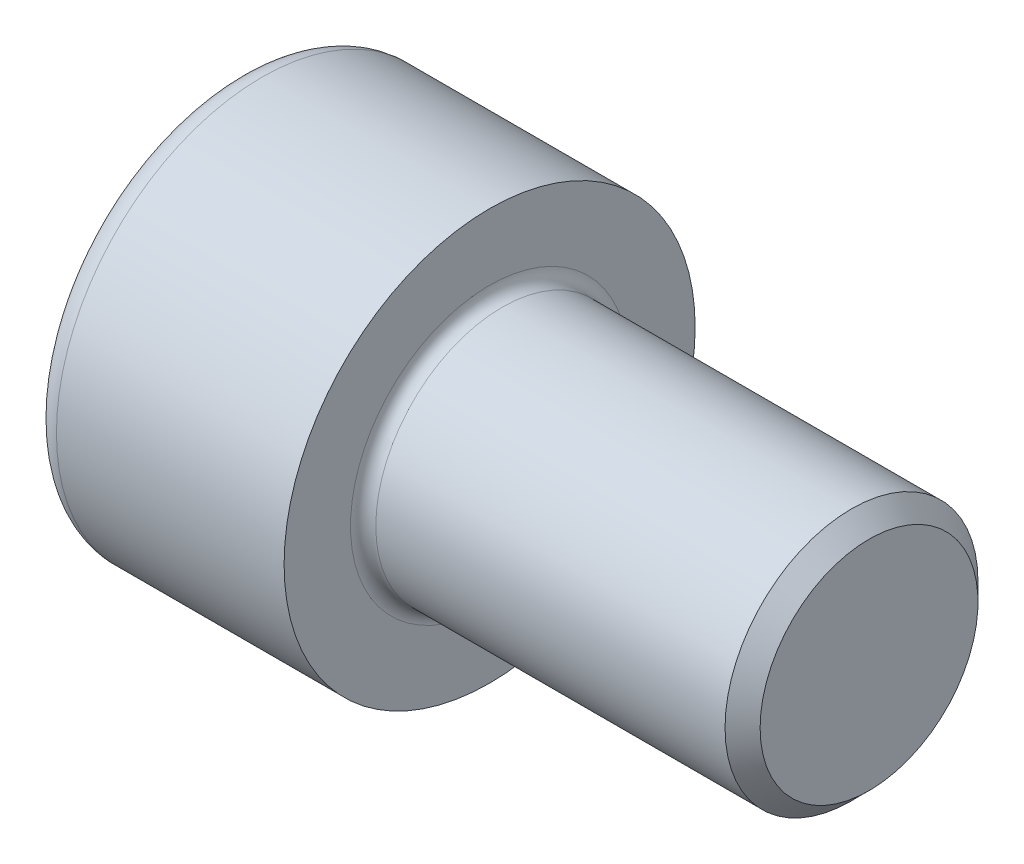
from build123d import *

# Parameters (mm, degrees)
FILLET1_R   = 0.4
FILLET2_R   = 0.8
HEX_2_DEPTH = 4


with BuildPart() as part:
    # BodySke → Base-Revolve (revolve)
    with BuildSketch(Plane.XY, mode=Mode.PRIVATE) as base_revolve_sk:
        Polygon((0, 0), (0, 6.5), (8, 6.5), (8, 4), (19.4455, 4), (20, 3.4455), (20, 0), align=None)
    revolve(base_revolve_sk.sketch.rotate(Axis((-31.75, 0, 0), (1, 0, 0)), 90), axis=Axis((-31.75, 0, 0), (1, 0, 0)))

    # Fillet1
    fillet1_edges = [part.edges().sort_by_distance(p)[0] for p in [
        (8, 0, -4),
    ]]
    fillet(fillet1_edges, radius=FILLET1_R)

    # Fillet2
    fillet2_edges = [part.edges().sort_by_distance(p)[0] for p in [
        (0, 0, -6.5),
    ]]
    fillet(fillet2_edges, radius=FILLET2_R)

    # Sketch2 → Hex-PreBroach (revolve, cut)
    with BuildSketch(Plane.XY, mode=Mode.PRIVATE) as hex_prebroach_sk:
        Polygon((0, 3.01), (4, 3.01), (5.73782431, 0), (0, 0), align=None)
    revolve(hex_prebroach_sk.sketch.rotate(Axis((0, 0, 0), (1, 0, 0)), 90), axis=Axis((0, 0, 0), (1, 0, 0)), mode=Mode.SUBTRACT)

    # Sketch3 → Hex 2 (cut)
    with BuildSketch(Plane(origin=(0, 0, 0), x_dir=(0, 0.500000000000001, 0.866025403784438), z_dir=(-1, 0, 0))):
        Polygon((1.73782431, 3.01), (-1.73782431, 3.01), (-3.475648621, 0), (-1.73782431, -3.01), (1.73782431, -3.01), (3.475648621, 0), align=None)
    extrude(amount=-HEX_2_DEPTH, mode=Mode.SUBTRACT)


solid = part.part
